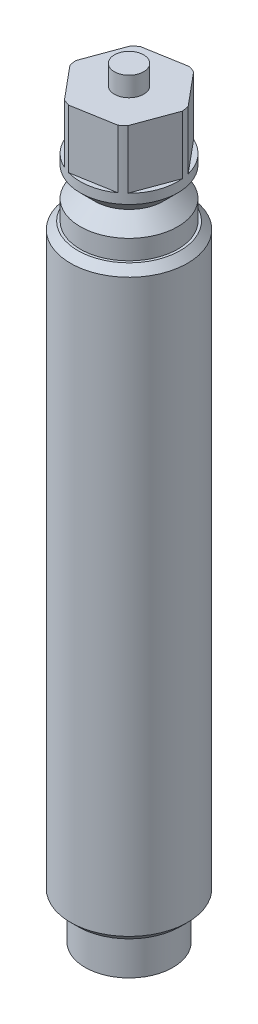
ISO-10303-21;
HEADER;
FILE_DESCRIPTION(('STEP AP214'),'2;1');
FILE_NAME('part.step','',(''),(''),'','','');
FILE_SCHEMA(('AUTOMOTIVE_DESIGN { 1 0 10303 214 1 1 1 1 }'));
ENDSEC;
DATA;
#1=APPLICATION_CONTEXT('core data for automotive mechanical design processes');
#2=APPLICATION_PROTOCOL_DEFINITION('international standard','automotive_design',2000,#1);
#3=PRODUCT_CONTEXT('',#1,'mechanical');
#4=PRODUCT('Part','Part','',(#3));
#5=PRODUCT_RELATED_PRODUCT_CATEGORY('part','',(#4));
#6=PRODUCT_DEFINITION_FORMATION('','',#4);
#7=PRODUCT_DEFINITION_CONTEXT('part definition',#1,'design');
#8=PRODUCT_DEFINITION('design','',#6,#7);
#9=PRODUCT_DEFINITION_SHAPE('','',#8);
#10=(LENGTH_UNIT() NAMED_UNIT(*) SI_UNIT(.MILLI.,.METRE.));
#11=(NAMED_UNIT(*) PLANE_ANGLE_UNIT() SI_UNIT($,.RADIAN.));
#12=(NAMED_UNIT(*) SI_UNIT($,.STERADIAN.) SOLID_ANGLE_UNIT());
#13=UNCERTAINTY_MEASURE_WITH_UNIT(LENGTH_MEASURE(1.E-05),#10,'distance_accuracy_value','');
#14=(GEOMETRIC_REPRESENTATION_CONTEXT(3) GLOBAL_UNCERTAINTY_ASSIGNED_CONTEXT((#13)) GLOBAL_UNIT_ASSIGNED_CONTEXT((#10,
#11,#12)) REPRESENTATION_CONTEXT('',''));
#15=CARTESIAN_POINT('',(0.,0.,0.));
#16=DIRECTION('',(0.,0.,1.));
#17=DIRECTION('',(1.,0.,0.));
#18=AXIS2_PLACEMENT_3D('',#15,#16,#17);
#19=CARTESIAN_POINT('',(0.,-60.,0.));
#20=DIRECTION('',(0.,-1.,0.));
#21=DIRECTION('',(0.,0.,-1.));
#22=AXIS2_PLACEMENT_3D('',#19,#20,#21);
#23=PLANE('',#22);
#24=CARTESIAN_POINT('',(0.,-60.,0.));
#25=DIRECTION('',(0.,-1.,0.));
#26=DIRECTION('',(0.,0.,-1.));
#27=AXIS2_PLACEMENT_3D('',#24,#25,#26);
#28=CIRCLE('',#27,5.25);
#29=CARTESIAN_POINT('',(0.,-60.,-5.25));
#30=VERTEX_POINT('',#29);
#31=EDGE_CURVE('E11',#30,#30,#28,.T.);
#32=ORIENTED_EDGE('',*,*,#31,.T.);
#33=EDGE_LOOP('',(#32));
#34=FACE_BOUND('',#33,.T.);
#35=CARTESIAN_POINT('',(0.,-60.,0.));
#36=DIRECTION('',(0.,-1.,0.));
#37=DIRECTION('',(0.,0.,-1.));
#38=AXIS2_PLACEMENT_3D('',#35,#36,#37);
#39=CIRCLE('',#38,4.5);
#40=CARTESIAN_POINT('',(0.,-60.,-4.5));
#41=VERTEX_POINT('',#40);
#42=EDGE_CURVE('E9362',#41,#41,#39,.T.);
#43=ORIENTED_EDGE('',*,*,#42,.F.);
#44=EDGE_LOOP('',(#43));
#45=FACE_BOUND('',#44,.T.);
#46=ADVANCED_FACE('F9174',(#34,#45),#23,.T.);
#47=CARTESIAN_POINT('',(0.,12.,0.));
#48=DIRECTION('',(0.,1.,0.));
#49=DIRECTION('',(0.,0.,1.));
#50=AXIS2_PLACEMENT_3D('',#47,#48,#49);
#51=PLANE('',#50);
#52=CARTESIAN_POINT('',(0.,12.,0.));
#53=DIRECTION('',(0.,1.,0.));
#54=DIRECTION('',(0.,0.,1.));
#55=AXIS2_PLACEMENT_3D('',#52,#53,#54);
#56=CIRCLE('',#55,1.5);
#57=CARTESIAN_POINT('',(0.,12.,1.5));
#58=VERTEX_POINT('',#57);
#59=EDGE_CURVE('E9402',#58,#58,#56,.T.);
#60=ORIENTED_EDGE('',*,*,#59,.F.);
#61=EDGE_LOOP('',(#60));
#62=FACE_BOUND('',#61,.T.);
#63=CARTESIAN_POINT('',(0.,12.,0.));
#64=DIRECTION('',(0.,1.,0.));
#65=DIRECTION('',(0.,0.,1.));
#66=AXIS2_PLACEMENT_3D('',#63,#64,#65);
#67=CIRCLE('',#66,5.);
#68=CARTESIAN_POINT('',(2.06183256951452,12.,-4.5550901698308));
#69=VERTEX_POINT('',#68);
#70=CARTESIAN_POINT('',(1.38132784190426,12.,-4.80540668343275));
#71=VERTEX_POINT('',#70);
#72=EDGE_CURVE('E9289',#69,#71,#67,.T.);
#73=ORIENTED_EDGE('',*,*,#72,.T.);
#74=DIRECTION('',(-0.985394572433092,0.,0.170286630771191));
#75=VECTOR('',#74,1.);
#76=CARTESIAN_POINT('',(1.79384035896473,12.,-4.87669322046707));
#77=LINE('',#76,#75);
#78=CARTESIAN_POINT('',(-2.91390751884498,12.,-4.06314446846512));
#79=VERTEX_POINT('',#78);
#80=EDGE_CURVE('E9274',#71,#79,#77,.T.);
#81=ORIENTED_EDGE('',*,*,#80,.T.);
#82=CARTESIAN_POINT('',(-3.47094034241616,12.,-3.5989683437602));
#83=VERTEX_POINT('',#82);
#84=EDGE_CURVE('E9281',#79,#83,#67,.T.);
#85=ORIENTED_EDGE('',*,*,#84,.T.);
#86=DIRECTION('',(-0.345224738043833,0.,0.938520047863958));
#87=VECTOR('',#86,1.);
#88=CARTESIAN_POINT('',(-3.32642003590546,12.,-3.99185793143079));
#89=LINE('',#88,#87);
#90=CARTESIAN_POINT('',(-4.9757400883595,12.,0.491945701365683));
#91=VERTEX_POINT('',#90);
#92=EDGE_CURVE('E9262',#83,#91,#89,.T.);
#93=ORIENTED_EDGE('',*,*,#92,.T.);
#94=CARTESIAN_POINT('',(-4.85226818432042,12.,1.20643833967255));
#95=VERTEX_POINT('',#94);
#96=EDGE_CURVE('E9290',#91,#95,#67,.T.);
#97=ORIENTED_EDGE('',*,*,#96,.T.);
#98=DIRECTION('',(0.640169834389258,0.,0.768233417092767));
#99=VECTOR('',#98,1.);
#100=CARTESIAN_POINT('',(-5.1202603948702,12.,0.884835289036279));
#101=LINE('',#100,#99);
#102=CARTESIAN_POINT('',(-2.06183256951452,12.,4.5550901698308));
#103=VERTEX_POINT('',#102);
#104=EDGE_CURVE('E9273',#95,#103,#101,.T.);
#105=ORIENTED_EDGE('',*,*,#104,.T.);
#106=CARTESIAN_POINT('',(-1.38132784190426,12.,4.80540668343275));
#107=VERTEX_POINT('',#106);
#108=EDGE_CURVE('E9293',#103,#107,#67,.T.);
#109=ORIENTED_EDGE('',*,*,#108,.T.);
#110=DIRECTION('',(0.985394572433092,0.,-0.170286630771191));
#111=VECTOR('',#110,1.);
#112=CARTESIAN_POINT('',(-1.79384035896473,12.,4.87669322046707));
#113=LINE('',#112,#111);
#114=CARTESIAN_POINT('',(2.91390751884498,12.,4.06314446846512));
#115=VERTEX_POINT('',#114);
#116=EDGE_CURVE('E9384',#107,#115,#113,.T.);
#117=ORIENTED_EDGE('',*,*,#116,.T.);
#118=CARTESIAN_POINT('',(3.47094034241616,12.,3.5989683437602));
#119=VERTEX_POINT('',#118);
#120=EDGE_CURVE('E9294',#115,#119,#67,.T.);
#121=ORIENTED_EDGE('',*,*,#120,.T.);
#122=DIRECTION('',(0.345224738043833,0.,-0.938520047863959));
#123=VECTOR('',#122,1.);
#124=CARTESIAN_POINT('',(3.32642003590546,12.,3.99185793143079));
#125=LINE('',#124,#123);
#126=CARTESIAN_POINT('',(4.9757400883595,12.,-0.491945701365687));
#127=VERTEX_POINT('',#126);
#128=EDGE_CURVE('E9387',#119,#127,#125,.T.);
#129=ORIENTED_EDGE('',*,*,#128,.T.);
#130=CARTESIAN_POINT('',(4.85226818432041,12.,-1.20643833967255));
#131=VERTEX_POINT('',#130);
#132=EDGE_CURVE('E9292',#127,#131,#67,.T.);
#133=ORIENTED_EDGE('',*,*,#132,.T.);
#134=DIRECTION('',(-0.640169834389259,0.,-0.768233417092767));
#135=VECTOR('',#134,1.);
#136=CARTESIAN_POINT('',(5.1202603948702,12.,-0.88483528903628));
#137=LINE('',#136,#135);
#138=EDGE_CURVE('E9390',#131,#69,#137,.T.);
#139=ORIENTED_EDGE('',*,*,#138,.T.);
#140=EDGE_LOOP('',(#73,#81,#85,#93,#97,#105,#109,#117,#121,#129,#133,#139));
#141=FACE_BOUND('',#140,.T.);
#142=ADVANCED_FACE('F9288',(#62,#141),#51,.T.);
#143=CARTESIAN_POINT('',(0.,12.,0.));
#144=DIRECTION('',(0.,-1.,0.));
#145=DIRECTION('',(0.,0.,-1.));
#146=AXIS2_PLACEMENT_3D('',#143,#144,#145);
#147=CYLINDRICAL_SURFACE('',#146,5.);
#148=CARTESIAN_POINT('',(0.,5.,0.));
#149=DIRECTION('',(0.,1.,0.));
#150=DIRECTION('',(0.,0.,1.));
#151=AXIS2_PLACEMENT_3D('',#148,#149,#150);
#152=CIRCLE('',#151,5.);
#153=CARTESIAN_POINT('',(0.,5.,5.));
#154=VERTEX_POINT('',#153);
#155=EDGE_CURVE('E9375',#154,#154,#152,.T.);
#156=ORIENTED_EDGE('',*,*,#155,.T.);
#157=EDGE_LOOP('',(#156));
#158=FACE_BOUND('',#157,.T.);
#159=DIRECTION('',(0.,-1.,0.));
#160=VECTOR('',#159,1.);
#161=CARTESIAN_POINT('',(1.38132784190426,12.,-4.80540668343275));
#162=LINE('',#161,#160);
#163=CARTESIAN_POINT('',(1.38132784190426,6.,-4.80540668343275));
#164=VERTEX_POINT('',#163);
#165=EDGE_CURVE('E9324',#71,#164,#162,.T.);
#166=ORIENTED_EDGE('',*,*,#165,.F.);
#167=ORIENTED_EDGE('',*,*,#72,.F.);
#168=DIRECTION('',(0.,-1.,0.));
#169=VECTOR('',#168,1.);
#170=CARTESIAN_POINT('',(2.06183256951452,12.,-4.5550901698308));
#171=LINE('',#170,#169);
#172=CARTESIAN_POINT('',(2.06183256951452,6.,-4.5550901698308));
#173=VERTEX_POINT('',#172);
#174=EDGE_CURVE('E9317',#173,#69,#171,.F.);
#175=ORIENTED_EDGE('',*,*,#174,.F.);
#176=CARTESIAN_POINT('',(0.,6.,0.));
#177=DIRECTION('',(0.,1.,0.));
#178=DIRECTION('',(0.,0.,1.));
#179=AXIS2_PLACEMENT_3D('',#176,#177,#178);
#180=CIRCLE('',#179,5.);
#181=CARTESIAN_POINT('',(4.85226818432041,6.,-1.20643833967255));
#182=VERTEX_POINT('',#181);
#183=EDGE_CURVE('E9319',#182,#173,#180,.T.);
#184=ORIENTED_EDGE('',*,*,#183,.F.);
#185=DIRECTION('',(0.,-1.,0.));
#186=VECTOR('',#185,1.);
#187=CARTESIAN_POINT('',(4.85226818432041,12.,-1.20643833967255));
#188=LINE('',#187,#186);
#189=EDGE_CURVE('E9320',#131,#182,#188,.T.);
#190=ORIENTED_EDGE('',*,*,#189,.F.);
#191=ORIENTED_EDGE('',*,*,#132,.F.);
#192=DIRECTION('',(0.,-1.,0.));
#193=VECTOR('',#192,1.);
#194=CARTESIAN_POINT('',(4.9757400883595,12.,-0.491945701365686));
#195=LINE('',#194,#193);
#196=CARTESIAN_POINT('',(4.9757400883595,6.,-0.491945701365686));
#197=VERTEX_POINT('',#196);
#198=EDGE_CURVE('E9312',#197,#127,#195,.F.);
#199=ORIENTED_EDGE('',*,*,#198,.F.);
#200=CARTESIAN_POINT('',(3.47094034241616,6.,3.5989683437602));
#201=VERTEX_POINT('',#200);
#202=EDGE_CURVE('E9314',#201,#197,#180,.T.);
#203=ORIENTED_EDGE('',*,*,#202,.F.);
#204=DIRECTION('',(0.,-1.,0.));
#205=VECTOR('',#204,1.);
#206=CARTESIAN_POINT('',(3.47094034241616,12.,3.5989683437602));
#207=LINE('',#206,#205);
#208=EDGE_CURVE('E9315',#119,#201,#207,.T.);
#209=ORIENTED_EDGE('',*,*,#208,.F.);
#210=ORIENTED_EDGE('',*,*,#120,.F.);
#211=DIRECTION('',(0.,-1.,0.));
#212=VECTOR('',#211,1.);
#213=CARTESIAN_POINT('',(2.91390751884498,12.,4.06314446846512));
#214=LINE('',#213,#212);
#215=CARTESIAN_POINT('',(2.91390751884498,6.,4.06314446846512));
#216=VERTEX_POINT('',#215);
#217=EDGE_CURVE('E9307',#216,#115,#214,.F.);
#218=ORIENTED_EDGE('',*,*,#217,.F.);
#219=CARTESIAN_POINT('',(-1.38132784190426,6.,4.80540668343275));
#220=VERTEX_POINT('',#219);
#221=EDGE_CURVE('E9309',#220,#216,#180,.T.);
#222=ORIENTED_EDGE('',*,*,#221,.F.);
#223=DIRECTION('',(0.,-1.,0.));
#224=VECTOR('',#223,1.);
#225=CARTESIAN_POINT('',(-1.38132784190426,12.,4.80540668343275));
#226=LINE('',#225,#224);
#227=EDGE_CURVE('E9310',#107,#220,#226,.T.);
#228=ORIENTED_EDGE('',*,*,#227,.F.);
#229=ORIENTED_EDGE('',*,*,#108,.F.);
#230=DIRECTION('',(0.,-1.,0.));
#231=VECTOR('',#230,1.);
#232=CARTESIAN_POINT('',(-2.06183256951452,12.,4.5550901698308));
#233=LINE('',#232,#231);
#234=CARTESIAN_POINT('',(-2.06183256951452,6.,4.5550901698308));
#235=VERTEX_POINT('',#234);
#236=EDGE_CURVE('E9284',#235,#103,#233,.F.);
#237=ORIENTED_EDGE('',*,*,#236,.F.);
#238=CARTESIAN_POINT('',(-4.85226818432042,6.,1.20643833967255));
#239=VERTEX_POINT('',#238);
#240=EDGE_CURVE('E9302',#239,#235,#180,.T.);
#241=ORIENTED_EDGE('',*,*,#240,.F.);
#242=DIRECTION('',(0.,-1.,0.));
#243=VECTOR('',#242,1.);
#244=CARTESIAN_POINT('',(-4.85226818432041,12.,1.20643833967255));
#245=LINE('',#244,#243);
#246=EDGE_CURVE('E9305',#95,#239,#245,.T.);
#247=ORIENTED_EDGE('',*,*,#246,.F.);
#248=ORIENTED_EDGE('',*,*,#96,.F.);
#249=DIRECTION('',(0.,-1.,0.));
#250=VECTOR('',#249,1.);
#251=CARTESIAN_POINT('',(-4.9757400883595,12.,0.491945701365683));
#252=LINE('',#251,#250);
#253=CARTESIAN_POINT('',(-4.9757400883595,6.,0.491945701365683));
#254=VERTEX_POINT('',#253);
#255=EDGE_CURVE('E9268',#254,#91,#252,.F.);
#256=ORIENTED_EDGE('',*,*,#255,.F.);
#257=CARTESIAN_POINT('',(-3.47094034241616,6.,-3.5989683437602));
#258=VERTEX_POINT('',#257);
#259=EDGE_CURVE('E9283',#258,#254,#180,.T.);
#260=ORIENTED_EDGE('',*,*,#259,.F.);
#261=DIRECTION('',(0.,-1.,0.));
#262=VECTOR('',#261,1.);
#263=CARTESIAN_POINT('',(-3.47094034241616,12.,-3.5989683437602));
#264=LINE('',#263,#262);
#265=EDGE_CURVE('E9265',#83,#258,#264,.T.);
#266=ORIENTED_EDGE('',*,*,#265,.F.);
#267=ORIENTED_EDGE('',*,*,#84,.F.);
#268=DIRECTION('',(0.,-1.,0.));
#269=VECTOR('',#268,1.);
#270=CARTESIAN_POINT('',(-2.91390751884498,12.,-4.06314446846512));
#271=LINE('',#270,#269);
#272=CARTESIAN_POINT('',(-2.91390751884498,6.,-4.06314446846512));
#273=VERTEX_POINT('',#272);
#274=EDGE_CURVE('E9322',#273,#79,#271,.F.);
#275=ORIENTED_EDGE('',*,*,#274,.F.);
#276=EDGE_CURVE('E9301',#164,#273,#180,.T.);
#277=ORIENTED_EDGE('',*,*,#276,.F.);
#278=EDGE_LOOP('',(#166,#167,#175,#184,#190,#191,#199,#203,#209,#210,#218,#222,#228,#229,#237,
#241,#247,#248,#256,#260,#266,#267,#275,#277));
#279=FACE_BOUND('',#278,.T.);
#280=ADVANCED_FACE('F9176',(#158,#279),#147,.T.);
#281=CARTESIAN_POINT('',(0.,14.,0.));
#282=DIRECTION('',(0.,-1.,0.));
#283=DIRECTION('',(0.,0.,-1.));
#284=AXIS2_PLACEMENT_3D('',#281,#282,#283);
#285=CYLINDRICAL_SURFACE('',#284,1.5);
#286=CARTESIAN_POINT('',(0.,14.,0.));
#287=DIRECTION('',(0.,1.,0.));
#288=DIRECTION('',(0.,0.,1.));
#289=AXIS2_PLACEMENT_3D('',#286,#287,#288);
#290=CIRCLE('',#289,1.5);
#291=CARTESIAN_POINT('',(0.,14.,1.5));
#292=VERTEX_POINT('',#291);
#293=EDGE_CURVE('E9298',#292,#292,#290,.T.);
#294=ORIENTED_EDGE('',*,*,#293,.F.);
#295=EDGE_LOOP('',(#294));
#296=FACE_BOUND('',#295,.T.);
#297=ORIENTED_EDGE('',*,*,#59,.T.);
#298=EDGE_LOOP('',(#297));
#299=FACE_BOUND('',#298,.T.);
#300=ADVANCED_FACE('F9591',(#296,#299),#285,.T.);
#301=CARTESIAN_POINT('',(0.,14.,0.));
#302=DIRECTION('',(0.,1.,0.));
#303=DIRECTION('',(0.,0.,1.));
#304=AXIS2_PLACEMENT_3D('',#301,#302,#303);
#305=PLANE('',#304);
#306=ORIENTED_EDGE('',*,*,#293,.T.);
#307=EDGE_LOOP('',(#306));
#308=FACE_BOUND('',#307,.T.);
#309=ADVANCED_FACE('F9461',(#308),#305,.T.);
#310=CARTESIAN_POINT('',(-3.32642003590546,6.,-3.99185793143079));
#311=DIRECTION('',(-0.938520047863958,0.,-0.345224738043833));
#312=DIRECTION('',(-0.345224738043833,0.,0.938520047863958));
#313=AXIS2_PLACEMENT_3D('',#310,#311,#312);
#314=PLANE('',#313);
#315=ORIENTED_EDGE('',*,*,#265,.T.);
#316=DIRECTION('',(-0.345224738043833,0.,0.938520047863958));
#317=VECTOR('',#316,1.);
#318=CARTESIAN_POINT('',(-3.32642003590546,6.,-3.99185793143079));
#319=LINE('',#318,#317);
#320=EDGE_CURVE('E9394',#258,#254,#319,.T.);
#321=ORIENTED_EDGE('',*,*,#320,.T.);
#322=ORIENTED_EDGE('',*,*,#255,.T.);
#323=ORIENTED_EDGE('',*,*,#92,.F.);
#324=EDGE_LOOP('',(#315,#321,#322,#323));
#325=FACE_BOUND('',#324,.T.);
#326=ADVANCED_FACE('F9264',(#325),#314,.T.);
#327=CARTESIAN_POINT('',(0.,6.,0.));
#328=DIRECTION('',(0.,1.,0.));
#329=DIRECTION('',(0.,0.,1.));
#330=AXIS2_PLACEMENT_3D('',#327,#328,#329);
#331=PLANE('',#330);
#332=ORIENTED_EDGE('',*,*,#259,.T.);
#333=ORIENTED_EDGE('',*,*,#320,.F.);
#334=EDGE_LOOP('',(#332,#333));
#335=FACE_BOUND('',#334,.T.);
#336=ADVANCED_FACE('F9442',(#335),#331,.T.);
#337=CARTESIAN_POINT('',(-5.1202603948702,6.,0.884835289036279));
#338=DIRECTION('',(-0.768233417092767,0.,0.640169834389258));
#339=DIRECTION('',(0.640169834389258,0.,0.768233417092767));
#340=AXIS2_PLACEMENT_3D('',#337,#338,#339);
#341=PLANE('',#340);
#342=ORIENTED_EDGE('',*,*,#246,.T.);
#343=DIRECTION('',(0.640169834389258,0.,0.768233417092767));
#344=VECTOR('',#343,1.);
#345=CARTESIAN_POINT('',(-5.1202603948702,6.,0.884835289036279));
#346=LINE('',#345,#344);
#347=EDGE_CURVE('E9396',#239,#235,#346,.T.);
#348=ORIENTED_EDGE('',*,*,#347,.T.);
#349=ORIENTED_EDGE('',*,*,#236,.T.);
#350=ORIENTED_EDGE('',*,*,#104,.F.);
#351=EDGE_LOOP('',(#342,#348,#349,#350));
#352=FACE_BOUND('',#351,.T.);
#353=ADVANCED_FACE('F9452',(#352),#341,.T.);
#354=ORIENTED_EDGE('',*,*,#240,.T.);
#355=ORIENTED_EDGE('',*,*,#347,.F.);
#356=EDGE_LOOP('',(#354,#355));
#357=FACE_BOUND('',#356,.T.);
#358=ADVANCED_FACE('F9454',(#357),#331,.T.);
#359=CARTESIAN_POINT('',(-1.79384035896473,6.,4.87669322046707));
#360=DIRECTION('',(0.170286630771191,0.,0.985394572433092));
#361=DIRECTION('',(0.985394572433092,0.,-0.170286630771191));
#362=AXIS2_PLACEMENT_3D('',#359,#360,#361);
#363=PLANE('',#362);
#364=ORIENTED_EDGE('',*,*,#227,.T.);
#365=DIRECTION('',(0.985394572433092,0.,-0.170286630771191));
#366=VECTOR('',#365,1.);
#367=CARTESIAN_POINT('',(-1.79384035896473,6.,4.87669322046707));
#368=LINE('',#367,#366);
#369=EDGE_CURVE('E9398',#220,#216,#368,.T.);
#370=ORIENTED_EDGE('',*,*,#369,.T.);
#371=ORIENTED_EDGE('',*,*,#217,.T.);
#372=ORIENTED_EDGE('',*,*,#116,.F.);
#373=EDGE_LOOP('',(#364,#370,#371,#372));
#374=FACE_BOUND('',#373,.T.);
#375=ADVANCED_FACE('F9420',(#374),#363,.T.);
#376=ORIENTED_EDGE('',*,*,#221,.T.);
#377=ORIENTED_EDGE('',*,*,#369,.F.);
#378=EDGE_LOOP('',(#376,#377));
#379=FACE_BOUND('',#378,.T.);
#380=ADVANCED_FACE('F9422',(#379),#331,.T.);
#381=CARTESIAN_POINT('',(3.32642003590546,6.,3.99185793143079));
#382=DIRECTION('',(0.938520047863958,0.,0.345224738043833));
#383=DIRECTION('',(0.345224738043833,0.,-0.938520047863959));
#384=AXIS2_PLACEMENT_3D('',#381,#382,#383);
#385=PLANE('',#384);
#386=ORIENTED_EDGE('',*,*,#208,.T.);
#387=DIRECTION('',(0.345224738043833,0.,-0.938520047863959));
#388=VECTOR('',#387,1.);
#389=CARTESIAN_POINT('',(3.32642003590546,6.,3.99185793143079));
#390=LINE('',#389,#388);
#391=EDGE_CURVE('E9400',#201,#197,#390,.T.);
#392=ORIENTED_EDGE('',*,*,#391,.T.);
#393=ORIENTED_EDGE('',*,*,#198,.T.);
#394=ORIENTED_EDGE('',*,*,#128,.F.);
#395=EDGE_LOOP('',(#386,#392,#393,#394));
#396=FACE_BOUND('',#395,.T.);
#397=ADVANCED_FACE('F9471',(#396),#385,.T.);
#398=ORIENTED_EDGE('',*,*,#202,.T.);
#399=ORIENTED_EDGE('',*,*,#391,.F.);
#400=EDGE_LOOP('',(#398,#399));
#401=FACE_BOUND('',#400,.T.);
#402=ADVANCED_FACE('F9449',(#401),#331,.T.);
#403=CARTESIAN_POINT('',(5.1202603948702,6.,-0.88483528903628));
#404=DIRECTION('',(0.768233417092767,0.,-0.640169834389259));
#405=DIRECTION('',(-0.640169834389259,0.,-0.768233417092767));
#406=AXIS2_PLACEMENT_3D('',#403,#404,#405);
#407=PLANE('',#406);
#408=ORIENTED_EDGE('',*,*,#189,.T.);
#409=DIRECTION('',(-0.640169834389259,0.,-0.768233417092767));
#410=VECTOR('',#409,1.);
#411=CARTESIAN_POINT('',(5.1202603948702,6.,-0.88483528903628));
#412=LINE('',#411,#410);
#413=EDGE_CURVE('E9197',#182,#173,#412,.T.);
#414=ORIENTED_EDGE('',*,*,#413,.T.);
#415=ORIENTED_EDGE('',*,*,#174,.T.);
#416=ORIENTED_EDGE('',*,*,#138,.F.);
#417=EDGE_LOOP('',(#408,#414,#415,#416));
#418=FACE_BOUND('',#417,.T.);
#419=ADVANCED_FACE('F9432',(#418),#407,.T.);
#420=ORIENTED_EDGE('',*,*,#183,.T.);
#421=ORIENTED_EDGE('',*,*,#413,.F.);
#422=EDGE_LOOP('',(#420,#421));
#423=FACE_BOUND('',#422,.T.);
#424=ADVANCED_FACE('F9434',(#423),#331,.T.);
#425=ORIENTED_EDGE('',*,*,#276,.T.);
#426=DIRECTION('',(-0.985394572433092,0.,0.170286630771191));
#427=VECTOR('',#426,1.);
#428=CARTESIAN_POINT('',(1.79384035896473,6.,-4.87669322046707));
#429=LINE('',#428,#427);
#430=EDGE_CURVE('E9189',#164,#273,#429,.T.);
#431=ORIENTED_EDGE('',*,*,#430,.F.);
#432=EDGE_LOOP('',(#425,#431));
#433=FACE_BOUND('',#432,.T.);
#434=ADVANCED_FACE('F9439',(#433),#331,.T.);
#435=CARTESIAN_POINT('',(1.79384035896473,6.,-4.87669322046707));
#436=DIRECTION('',(-0.170286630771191,0.,-0.985394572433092));
#437=DIRECTION('',(-0.985394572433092,0.,0.170286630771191));
#438=AXIS2_PLACEMENT_3D('',#435,#436,#437);
#439=PLANE('',#438);
#440=ORIENTED_EDGE('',*,*,#165,.T.);
#441=ORIENTED_EDGE('',*,*,#430,.T.);
#442=ORIENTED_EDGE('',*,*,#274,.T.);
#443=ORIENTED_EDGE('',*,*,#80,.F.);
#444=EDGE_LOOP('',(#440,#441,#442,#443));
#445=FACE_BOUND('',#444,.T.);
#446=ADVANCED_FACE('F9437',(#445),#439,.T.);
#447=CARTESIAN_POINT('',(0.,2.,0.));
#448=DIRECTION('',(0.,-1.,0.));
#449=DIRECTION('',(0.,0.,-1.));
#450=AXIS2_PLACEMENT_3D('',#447,#448,#449);
#451=CONICAL_SURFACE('',#450,5.,0.785398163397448);
#452=CARTESIAN_POINT('',(0.,3.5,0.));
#453=DIRECTION('',(0.,1.,0.));
#454=DIRECTION('',(0.,0.,1.));
#455=AXIS2_PLACEMENT_3D('',#452,#453,#454);
#456=CIRCLE('',#455,3.5);
#457=CARTESIAN_POINT('',(0.,3.5,3.5));
#458=VERTEX_POINT('',#457);
#459=EDGE_CURVE('E9372',#458,#458,#456,.T.);
#460=ORIENTED_EDGE('',*,*,#459,.F.);
#461=EDGE_LOOP('',(#460));
#462=FACE_BOUND('',#461,.T.);
#463=CARTESIAN_POINT('',(0.,2.,0.));
#464=DIRECTION('',(0.,1.,0.));
#465=DIRECTION('',(0.,0.,1.));
#466=AXIS2_PLACEMENT_3D('',#463,#464,#465);
#467=CIRCLE('',#466,5.);
#468=CARTESIAN_POINT('',(0.,2.,5.));
#469=VERTEX_POINT('',#468);
#470=EDGE_CURVE('E9378',#469,#469,#467,.T.);
#471=ORIENTED_EDGE('',*,*,#470,.T.);
#472=EDGE_LOOP('',(#471));
#473=FACE_BOUND('',#472,.T.);
#474=ADVANCED_FACE('F9447',(#462,#473),#451,.T.);
#475=CARTESIAN_POINT('',(0.,3.5,0.));
#476=DIRECTION('',(0.,1.,0.));
#477=DIRECTION('',(0.,0.,1.));
#478=AXIS2_PLACEMENT_3D('',#475,#476,#477);
#479=CONICAL_SURFACE('',#478,3.5,0.785398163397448);
#480=ORIENTED_EDGE('',*,*,#155,.F.);
#481=EDGE_LOOP('',(#480));
#482=FACE_BOUND('',#481,.T.);
#483=ORIENTED_EDGE('',*,*,#459,.T.);
#484=EDGE_LOOP('',(#483));
#485=FACE_BOUND('',#484,.T.);
#486=ADVANCED_FACE('F9489',(#482,#485),#479,.T.);
#487=ORIENTED_EDGE('',*,*,#470,.F.);
#488=EDGE_LOOP('',(#487));
#489=FACE_BOUND('',#488,.T.);
#490=CARTESIAN_POINT('',(0.,0.,0.));
#491=DIRECTION('',(0.,-1.,0.));
#492=DIRECTION('',(0.,0.,-1.));
#493=AXIS2_PLACEMENT_3D('',#490,#491,#492);
#494=CIRCLE('',#493,5.);
#495=CARTESIAN_POINT('',(0.,0.,-5.));
#496=VERTEX_POINT('',#495);
#497=EDGE_CURVE('E9367',#496,#496,#494,.T.);
#498=ORIENTED_EDGE('',*,*,#497,.F.);
#499=EDGE_LOOP('',(#498));
#500=FACE_BOUND('',#499,.T.);
#501=ADVANCED_FACE('F9492',(#489,#500),#147,.T.);
#502=CARTESIAN_POINT('',(0.,0.,0.));
#503=DIRECTION('',(0.,-1.,0.));
#504=DIRECTION('',(0.,0.,-1.));
#505=AXIS2_PLACEMENT_3D('',#502,#503,#504);
#506=PLANE('',#505);
#507=CARTESIAN_POINT('',(0.,0.,0.));
#508=DIRECTION('',(0.,-1.,0.));
#509=DIRECTION('',(0.,0.,-1.));
#510=AXIS2_PLACEMENT_3D('',#507,#508,#509);
#511=CIRCLE('',#510,5.25);
#512=CARTESIAN_POINT('',(0.,0.,-5.25));
#513=VERTEX_POINT('',#512);
#514=EDGE_CURVE('E9182',#513,#513,#511,.F.);
#515=ORIENTED_EDGE('',*,*,#514,.T.);
#516=EDGE_LOOP('',(#515));
#517=FACE_BOUND('',#516,.T.);
#518=ORIENTED_EDGE('',*,*,#497,.T.);
#519=EDGE_LOOP('',(#518));
#520=FACE_BOUND('',#519,.T.);
#521=ADVANCED_FACE('F9334',(#517,#520),#506,.F.);
#522=CARTESIAN_POINT('',(0.,-60.,0.));
#523=DIRECTION('',(0.,1.,0.));
#524=DIRECTION('',(0.,0.,1.));
#525=AXIS2_PLACEMENT_3D('',#522,#523,#524);
#526=CYLINDRICAL_SURFACE('',#525,6.);
#527=CARTESIAN_POINT('',(0.,-0.750000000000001,0.));
#528=DIRECTION('',(0.,-1.,0.));
#529=DIRECTION('',(0.,0.,-1.));
#530=AXIS2_PLACEMENT_3D('',#527,#528,#529);
#531=CIRCLE('',#530,6.);
#532=CARTESIAN_POINT('',(0.,-0.750000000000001,-6.));
#533=VERTEX_POINT('',#532);
#534=EDGE_CURVE('E9329',#533,#533,#531,.T.);
#535=ORIENTED_EDGE('',*,*,#534,.T.);
#536=EDGE_LOOP('',(#535));
#537=FACE_BOUND('',#536,.T.);
#538=CARTESIAN_POINT('',(0.,-59.25,0.));
#539=DIRECTION('',(0.,-1.,0.));
#540=DIRECTION('',(0.,0.,-1.));
#541=AXIS2_PLACEMENT_3D('',#538,#539,#540);
#542=CIRCLE('',#541,6.);
#543=CARTESIAN_POINT('',(0.,-59.25,-6.));
#544=VERTEX_POINT('',#543);
#545=EDGE_CURVE('E9326',#544,#544,#542,.F.);
#546=ORIENTED_EDGE('',*,*,#545,.T.);
#547=EDGE_LOOP('',(#546));
#548=FACE_BOUND('',#547,.T.);
#549=ADVANCED_FACE('F9345',(#537,#548),#526,.T.);
#550=CARTESIAN_POINT('',(0.,-64.,0.));
#551=DIRECTION('',(0.,1.,0.));
#552=DIRECTION('',(0.,0.,1.));
#553=AXIS2_PLACEMENT_3D('',#550,#551,#552);
#554=CYLINDRICAL_SURFACE('',#553,4.5);
#555=CARTESIAN_POINT('',(0.,-64.,0.));
#556=DIRECTION('',(0.,-1.,0.));
#557=DIRECTION('',(0.,0.,-1.));
#558=AXIS2_PLACEMENT_3D('',#555,#556,#557);
#559=CIRCLE('',#558,4.5);
#560=CARTESIAN_POINT('',(0.,-64.,-4.5));
#561=VERTEX_POINT('',#560);
#562=EDGE_CURVE('E9364',#561,#561,#559,.T.);
#563=ORIENTED_EDGE('',*,*,#562,.F.);
#564=EDGE_LOOP('',(#563));
#565=FACE_BOUND('',#564,.T.);
#566=ORIENTED_EDGE('',*,*,#42,.T.);
#567=EDGE_LOOP('',(#566));
#568=FACE_BOUND('',#567,.T.);
#569=ADVANCED_FACE('F9348',(#565,#568),#554,.T.);
#570=CARTESIAN_POINT('',(0.,-64.,0.));
#571=DIRECTION('',(0.,-1.,0.));
#572=DIRECTION('',(0.,0.,-1.));
#573=AXIS2_PLACEMENT_3D('',#570,#571,#572);
#574=PLANE('',#573);
#575=ORIENTED_EDGE('',*,*,#562,.T.);
#576=EDGE_LOOP('',(#575));
#577=FACE_BOUND('',#576,.T.);
#578=ADVANCED_FACE('F9341',(#577),#574,.T.);
#579=CARTESIAN_POINT('',(0.,-0.750000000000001,0.));
#580=DIRECTION('',(0.,-1.,0.));
#581=DIRECTION('',(0.,0.,-1.));
#582=AXIS2_PLACEMENT_3D('',#579,#580,#581);
#583=CONICAL_SURFACE('',#582,6.,0.785398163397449);
#584=ORIENTED_EDGE('',*,*,#514,.F.);
#585=EDGE_LOOP('',(#584));
#586=FACE_BOUND('',#585,.T.);
#587=ORIENTED_EDGE('',*,*,#534,.F.);
#588=EDGE_LOOP('',(#587));
#589=FACE_BOUND('',#588,.T.);
#590=ADVANCED_FACE('F9337',(#586,#589),#583,.T.);
#591=CARTESIAN_POINT('',(0.,-60.,0.));
#592=DIRECTION('',(0.,1.,0.));
#593=DIRECTION('',(0.,0.,1.));
#594=AXIS2_PLACEMENT_3D('',#591,#592,#593);
#595=CONICAL_SURFACE('',#594,5.25,0.785398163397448);
#596=ORIENTED_EDGE('',*,*,#545,.F.);
#597=EDGE_LOOP('',(#596));
#598=FACE_BOUND('',#597,.T.);
#599=ORIENTED_EDGE('',*,*,#31,.F.);
#600=EDGE_LOOP('',(#599));
#601=FACE_BOUND('',#600,.T.);
#602=ADVANCED_FACE('F9340',(#598,#601),#595,.T.);
#603=CLOSED_SHELL('',(#46,#142,#280,#300,#309,#326,#336,#353,#358,#375,#380,#397,#402,#419,#424,
#434,#446,#474,#486,#501,#521,#549,#569,#578,#590,#602));
#604=MANIFOLD_SOLID_BREP('B2',#603);
#605=ADVANCED_BREP_SHAPE_REPRESENTATION('',(#18,#604),#14);
#606=SHAPE_DEFINITION_REPRESENTATION(#9,#605);
ENDSEC;
END-ISO-10303-21;
